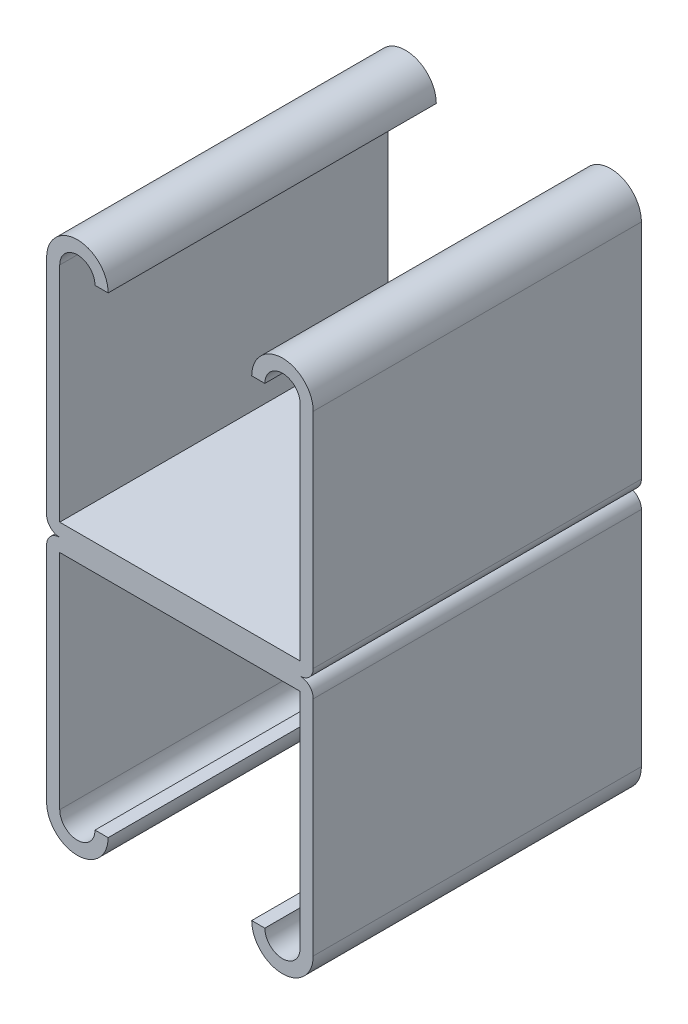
ISO-10303-21;
HEADER;
FILE_DESCRIPTION(('STEP AP214'),'2;1');
FILE_NAME('part.step','',(''),(''),'','','');
FILE_SCHEMA(('AUTOMOTIVE_DESIGN { 1 0 10303 214 1 1 1 1 }'));
ENDSEC;
DATA;
#1=APPLICATION_CONTEXT('core data for automotive mechanical design processes');
#2=APPLICATION_PROTOCOL_DEFINITION('international standard','automotive_design',2000,#1);
#3=PRODUCT_CONTEXT('',#1,'mechanical');
#4=PRODUCT('Part','Part','',(#3));
#5=PRODUCT_RELATED_PRODUCT_CATEGORY('part','',(#4));
#6=PRODUCT_DEFINITION_FORMATION('','',#4);
#7=PRODUCT_DEFINITION_CONTEXT('part definition',#1,'design');
#8=PRODUCT_DEFINITION('design','',#6,#7);
#9=PRODUCT_DEFINITION_SHAPE('','',#8);
#10=(LENGTH_UNIT() NAMED_UNIT(*) SI_UNIT(.MILLI.,.METRE.));
#11=(NAMED_UNIT(*) PLANE_ANGLE_UNIT() SI_UNIT($,.RADIAN.));
#12=(NAMED_UNIT(*) SI_UNIT($,.STERADIAN.) SOLID_ANGLE_UNIT());
#13=UNCERTAINTY_MEASURE_WITH_UNIT(LENGTH_MEASURE(1.E-05),#10,'distance_accuracy_value','');
#14=(GEOMETRIC_REPRESENTATION_CONTEXT(3) GLOBAL_UNCERTAINTY_ASSIGNED_CONTEXT((#13)) GLOBAL_UNIT_ASSIGNED_CONTEXT((#10,
#11,#12)) REPRESENTATION_CONTEXT('',''));
#15=CARTESIAN_POINT('',(0.,0.,0.));
#16=DIRECTION('',(0.,0.,1.));
#17=DIRECTION('',(1.,0.,0.));
#18=AXIS2_PLACEMENT_3D('',#15,#16,#17);
#19=CARTESIAN_POINT('',(-7.9375,18.25625,12.7));
#20=DIRECTION('',(0.,0.,-1.));
#21=DIRECTION('',(-1.,0.,0.));
#22=AXIS2_PLACEMENT_3D('',#19,#20,#21);
#23=CYLINDRICAL_SURFACE('',#22,2.38125);
#24=CARTESIAN_POINT('',(-7.9375,18.25625,-12.7));
#25=DIRECTION('',(0.,0.,1.));
#26=DIRECTION('',(-1.,0.,0.));
#27=AXIS2_PLACEMENT_3D('',#24,#25,#26);
#28=CIRCLE('',#27,2.38125);
#29=CARTESIAN_POINT('',(-5.55625,18.25625,-12.7));
#30=VERTEX_POINT('',#29);
#31=CARTESIAN_POINT('',(-10.31875,18.25625,-12.7));
#32=VERTEX_POINT('',#31);
#33=EDGE_CURVE('E165',#30,#32,#28,.T.);
#34=ORIENTED_EDGE('',*,*,#33,.T.);
#35=DIRECTION('',(0.,0.,-1.));
#36=VECTOR('',#35,1.);
#37=CARTESIAN_POINT('',(-10.31875,18.25625,12.7));
#38=LINE('',#37,#36);
#39=CARTESIAN_POINT('',(-10.31875,18.25625,12.7));
#40=VERTEX_POINT('',#39);
#41=EDGE_CURVE('E11',#40,#32,#38,.T.);
#42=ORIENTED_EDGE('',*,*,#41,.F.);
#43=CARTESIAN_POINT('',(-7.9375,18.25625,12.7));
#44=DIRECTION('',(0.,0.,1.));
#45=DIRECTION('',(-1.,0.,0.));
#46=AXIS2_PLACEMENT_3D('',#43,#44,#45);
#47=CIRCLE('',#46,2.38125);
#48=CARTESIAN_POINT('',(-5.55625,18.25625,12.7));
#49=VERTEX_POINT('',#48);
#50=EDGE_CURVE('E190',#49,#40,#47,.T.);
#51=ORIENTED_EDGE('',*,*,#50,.F.);
#52=DIRECTION('',(0.,0.,-1.));
#53=VECTOR('',#52,1.);
#54=CARTESIAN_POINT('',(-5.55625,18.25625,12.7));
#55=LINE('',#54,#53);
#56=EDGE_CURVE('E161',#49,#30,#55,.T.);
#57=ORIENTED_EDGE('',*,*,#56,.T.);
#58=EDGE_LOOP('',(#34,#42,#51,#57));
#59=FACE_BOUND('',#58,.T.);
#60=ADVANCED_FACE('F32',(#59),#23,.T.);
#61=CARTESIAN_POINT('',(-10.31875,18.25625,12.7));
#62=DIRECTION('',(1.,0.,0.));
#63=DIRECTION('',(0.,1.,0.));
#64=AXIS2_PLACEMENT_3D('',#61,#62,#63);
#65=PLANE('',#64);
#66=DIRECTION('',(0.,-1.,0.));
#67=VECTOR('',#66,1.);
#68=CARTESIAN_POINT('',(-10.31875,18.25625,-12.7));
#69=LINE('',#68,#67);
#70=CARTESIAN_POINT('',(-10.31875,1.016,-12.7));
#71=VERTEX_POINT('',#70);
#72=EDGE_CURVE('E168',#32,#71,#69,.T.);
#73=ORIENTED_EDGE('',*,*,#72,.T.);
#74=DIRECTION('',(0.,0.,-1.));
#75=VECTOR('',#74,1.);
#76=CARTESIAN_POINT('',(-10.31875,1.016,12.7));
#77=LINE('',#76,#75);
#78=CARTESIAN_POINT('',(-10.31875,1.016,12.7));
#79=VERTEX_POINT('',#78);
#80=EDGE_CURVE('E40',#79,#71,#77,.T.);
#81=ORIENTED_EDGE('',*,*,#80,.F.);
#82=DIRECTION('',(0.,-1.,0.));
#83=VECTOR('',#82,1.);
#84=CARTESIAN_POINT('',(-10.31875,18.25625,12.7));
#85=LINE('',#84,#83);
#86=EDGE_CURVE('E107',#40,#79,#85,.T.);
#87=ORIENTED_EDGE('',*,*,#86,.F.);
#88=ORIENTED_EDGE('',*,*,#41,.T.);
#89=EDGE_LOOP('',(#73,#81,#87,#88));
#90=FACE_BOUND('',#89,.T.);
#91=ADVANCED_FACE('F320',(#90),#65,.F.);
#92=CARTESIAN_POINT('',(-9.30275,1.016,12.7));
#93=DIRECTION('',(0.,0.,-1.));
#94=DIRECTION('',(-1.,0.,0.));
#95=AXIS2_PLACEMENT_3D('',#92,#93,#94);
#96=CYLINDRICAL_SURFACE('',#95,1.016);
#97=CARTESIAN_POINT('',(-9.30275,1.016,-12.7));
#98=DIRECTION('',(0.,0.,1.));
#99=DIRECTION('',(-1.,0.,0.));
#100=AXIS2_PLACEMENT_3D('',#97,#98,#99);
#101=CIRCLE('',#100,1.016);
#102=CARTESIAN_POINT('',(-9.30275,0.,-12.7));
#103=VERTEX_POINT('',#102);
#104=EDGE_CURVE('E171',#71,#103,#101,.T.);
#105=ORIENTED_EDGE('',*,*,#104,.T.);
#106=DIRECTION('',(0.,0.,-1.));
#107=VECTOR('',#106,1.);
#108=CARTESIAN_POINT('',(-9.30275,0.,12.7));
#109=LINE('',#108,#107);
#110=CARTESIAN_POINT('',(-9.30275,0.,12.7));
#111=VERTEX_POINT('',#110);
#112=EDGE_CURVE('E215',#111,#103,#109,.T.);
#113=ORIENTED_EDGE('',*,*,#112,.F.);
#114=CARTESIAN_POINT('',(-9.30275,1.016,12.7));
#115=DIRECTION('',(0.,0.,1.));
#116=DIRECTION('',(-1.,0.,0.));
#117=AXIS2_PLACEMENT_3D('',#114,#115,#116);
#118=CIRCLE('',#117,1.016);
#119=EDGE_CURVE('E223',#79,#111,#118,.T.);
#120=ORIENTED_EDGE('',*,*,#119,.F.);
#121=ORIENTED_EDGE('',*,*,#80,.T.);
#122=EDGE_LOOP('',(#105,#113,#120,#121));
#123=FACE_BOUND('',#122,.T.);
#124=ADVANCED_FACE('F221',(#123),#96,.T.);
#125=CARTESIAN_POINT('',(9.30275,1.016,12.7));
#126=DIRECTION('',(0.,0.,-1.));
#127=DIRECTION('',(-1.,0.,0.));
#128=AXIS2_PLACEMENT_3D('',#125,#126,#127);
#129=CYLINDRICAL_SURFACE('',#128,1.016);
#130=CARTESIAN_POINT('',(9.30275,1.016,-12.7));
#131=DIRECTION('',(0.,0.,1.));
#132=DIRECTION('',(1.,0.,0.));
#133=AXIS2_PLACEMENT_3D('',#130,#131,#132);
#134=CIRCLE('',#133,1.016);
#135=CARTESIAN_POINT('',(9.30275,0.,-12.7));
#136=VERTEX_POINT('',#135);
#137=CARTESIAN_POINT('',(10.31875,1.016,-12.7));
#138=VERTEX_POINT('',#137);
#139=EDGE_CURVE('E173',#136,#138,#134,.T.);
#140=ORIENTED_EDGE('',*,*,#139,.T.);
#141=DIRECTION('',(0.,0.,-1.));
#142=VECTOR('',#141,1.);
#143=CARTESIAN_POINT('',(10.31875,1.016,12.7));
#144=LINE('',#143,#142);
#145=CARTESIAN_POINT('',(10.31875,1.016,12.7));
#146=VERTEX_POINT('',#145);
#147=EDGE_CURVE('E209',#146,#138,#144,.T.);
#148=ORIENTED_EDGE('',*,*,#147,.F.);
#149=CARTESIAN_POINT('',(9.30275,1.016,12.7));
#150=DIRECTION('',(0.,0.,1.));
#151=DIRECTION('',(1.,0.,0.));
#152=AXIS2_PLACEMENT_3D('',#149,#150,#151);
#153=CIRCLE('',#152,1.016);
#154=CARTESIAN_POINT('',(9.30275,0.,12.7));
#155=VERTEX_POINT('',#154);
#156=EDGE_CURVE('E285',#155,#146,#153,.T.);
#157=ORIENTED_EDGE('',*,*,#156,.F.);
#158=DIRECTION('',(0.,0.,-1.));
#159=VECTOR('',#158,1.);
#160=CARTESIAN_POINT('',(9.30275,0.,12.7));
#161=LINE('',#160,#159);
#162=EDGE_CURVE('E212',#155,#136,#161,.T.);
#163=ORIENTED_EDGE('',*,*,#162,.T.);
#164=EDGE_LOOP('',(#140,#148,#157,#163));
#165=FACE_BOUND('',#164,.T.);
#166=ADVANCED_FACE('F327',(#165),#129,.T.);
#167=CARTESIAN_POINT('',(10.31875,1.016,12.7));
#168=DIRECTION('',(-1.,0.,0.));
#169=DIRECTION('',(0.,-1.,0.));
#170=AXIS2_PLACEMENT_3D('',#167,#168,#169);
#171=PLANE('',#170);
#172=DIRECTION('',(0.,1.,0.));
#173=VECTOR('',#172,1.);
#174=CARTESIAN_POINT('',(10.31875,1.016,-12.7));
#175=LINE('',#174,#173);
#176=CARTESIAN_POINT('',(10.31875,18.25625,-12.7));
#177=VERTEX_POINT('',#176);
#178=EDGE_CURVE('E175',#138,#177,#175,.T.);
#179=ORIENTED_EDGE('',*,*,#178,.T.);
#180=DIRECTION('',(0.,0.,-1.));
#181=VECTOR('',#180,1.);
#182=CARTESIAN_POINT('',(10.31875,18.25625,12.7));
#183=LINE('',#182,#181);
#184=CARTESIAN_POINT('',(10.31875,18.25625,12.7));
#185=VERTEX_POINT('',#184);
#186=EDGE_CURVE('E206',#185,#177,#183,.T.);
#187=ORIENTED_EDGE('',*,*,#186,.F.);
#188=DIRECTION('',(0.,1.,0.));
#189=VECTOR('',#188,1.);
#190=CARTESIAN_POINT('',(10.31875,1.016,12.7));
#191=LINE('',#190,#189);
#192=EDGE_CURVE('E287',#146,#185,#191,.T.);
#193=ORIENTED_EDGE('',*,*,#192,.F.);
#194=ORIENTED_EDGE('',*,*,#147,.T.);
#195=EDGE_LOOP('',(#179,#187,#193,#194));
#196=FACE_BOUND('',#195,.T.);
#197=ADVANCED_FACE('F332',(#196),#171,.F.);
#198=CARTESIAN_POINT('',(7.9375,18.25625,12.7));
#199=DIRECTION('',(0.,0.,-1.));
#200=DIRECTION('',(-1.,0.,0.));
#201=AXIS2_PLACEMENT_3D('',#198,#199,#200);
#202=CYLINDRICAL_SURFACE('',#201,2.38125);
#203=CARTESIAN_POINT('',(7.9375,18.25625,-12.7));
#204=DIRECTION('',(0.,0.,1.));
#205=DIRECTION('',(1.,0.,0.));
#206=AXIS2_PLACEMENT_3D('',#203,#204,#205);
#207=CIRCLE('',#206,2.38125);
#208=CARTESIAN_POINT('',(5.55625,18.25625,-12.7));
#209=VERTEX_POINT('',#208);
#210=EDGE_CURVE('E177',#177,#209,#207,.T.);
#211=ORIENTED_EDGE('',*,*,#210,.T.);
#212=DIRECTION('',(0.,0.,-1.));
#213=VECTOR('',#212,1.);
#214=CARTESIAN_POINT('',(5.55625,18.25625,12.7));
#215=LINE('',#214,#213);
#216=CARTESIAN_POINT('',(5.55625,18.25625,12.7));
#217=VERTEX_POINT('',#216);
#218=EDGE_CURVE('E203',#217,#209,#215,.T.);
#219=ORIENTED_EDGE('',*,*,#218,.F.);
#220=CARTESIAN_POINT('',(7.9375,18.25625,12.7));
#221=DIRECTION('',(0.,0.,1.));
#222=DIRECTION('',(1.,0.,0.));
#223=AXIS2_PLACEMENT_3D('',#220,#221,#222);
#224=CIRCLE('',#223,2.38125);
#225=EDGE_CURVE('E289',#185,#217,#224,.T.);
#226=ORIENTED_EDGE('',*,*,#225,.F.);
#227=ORIENTED_EDGE('',*,*,#186,.T.);
#228=EDGE_LOOP('',(#211,#219,#226,#227));
#229=FACE_BOUND('',#228,.T.);
#230=ADVANCED_FACE('F336',(#229),#202,.T.);
#231=CARTESIAN_POINT('',(5.55625,18.25625,12.7));
#232=DIRECTION('',(0.,1.,0.));
#233=DIRECTION('',(0.,0.,1.));
#234=AXIS2_PLACEMENT_3D('',#231,#232,#233);
#235=PLANE('',#234);
#236=DIRECTION('',(1.,0.,0.));
#237=VECTOR('',#236,1.);
#238=CARTESIAN_POINT('',(5.55625,18.25625,-12.7));
#239=LINE('',#238,#237);
#240=CARTESIAN_POINT('',(6.57225,18.25625,-12.7));
#241=VERTEX_POINT('',#240);
#242=EDGE_CURVE('E179',#209,#241,#239,.T.);
#243=ORIENTED_EDGE('',*,*,#242,.T.);
#244=DIRECTION('',(0.,0.,-1.));
#245=VECTOR('',#244,1.);
#246=CARTESIAN_POINT('',(6.57225,18.25625,12.7));
#247=LINE('',#246,#245);
#248=CARTESIAN_POINT('',(6.57225,18.25625,12.7));
#249=VERTEX_POINT('',#248);
#250=EDGE_CURVE('E200',#249,#241,#247,.T.);
#251=ORIENTED_EDGE('',*,*,#250,.F.);
#252=DIRECTION('',(1.,0.,0.));
#253=VECTOR('',#252,1.);
#254=CARTESIAN_POINT('',(5.55625,18.25625,12.7));
#255=LINE('',#254,#253);
#256=EDGE_CURVE('E291',#217,#249,#255,.T.);
#257=ORIENTED_EDGE('',*,*,#256,.F.);
#258=ORIENTED_EDGE('',*,*,#218,.T.);
#259=EDGE_LOOP('',(#243,#251,#257,#258));
#260=FACE_BOUND('',#259,.T.);
#261=ADVANCED_FACE('F340',(#260),#235,.F.);
#262=CARTESIAN_POINT('',(7.9375,18.25625,12.7));
#263=DIRECTION('',(0.,0.,-1.));
#264=DIRECTION('',(-1.,0.,0.));
#265=AXIS2_PLACEMENT_3D('',#262,#263,#264);
#266=CYLINDRICAL_SURFACE('',#265,1.36525);
#267=CARTESIAN_POINT('',(7.9375,18.25625,-12.7));
#268=DIRECTION('',(0.,0.,-1.));
#269=DIRECTION('',(1.,0.,0.));
#270=AXIS2_PLACEMENT_3D('',#267,#268,#269);
#271=CIRCLE('',#270,1.36525);
#272=CARTESIAN_POINT('',(9.30275,18.25625,-12.7));
#273=VERTEX_POINT('',#272);
#274=EDGE_CURVE('E181',#241,#273,#271,.T.);
#275=ORIENTED_EDGE('',*,*,#274,.T.);
#276=DIRECTION('',(0.,0.,-1.));
#277=VECTOR('',#276,1.);
#278=CARTESIAN_POINT('',(9.30275,18.25625,12.7));
#279=LINE('',#278,#277);
#280=CARTESIAN_POINT('',(9.30275,18.25625,12.7));
#281=VERTEX_POINT('',#280);
#282=EDGE_CURVE('E197',#281,#273,#279,.T.);
#283=ORIENTED_EDGE('',*,*,#282,.F.);
#284=CARTESIAN_POINT('',(7.9375,18.25625,12.7));
#285=DIRECTION('',(0.,0.,-1.));
#286=DIRECTION('',(1.,0.,0.));
#287=AXIS2_PLACEMENT_3D('',#284,#285,#286);
#288=CIRCLE('',#287,1.36525);
#289=EDGE_CURVE('E293',#249,#281,#288,.T.);
#290=ORIENTED_EDGE('',*,*,#289,.F.);
#291=ORIENTED_EDGE('',*,*,#250,.T.);
#292=EDGE_LOOP('',(#275,#283,#290,#291));
#293=FACE_BOUND('',#292,.T.);
#294=ADVANCED_FACE('F344',(#293),#266,.F.);
#295=CARTESIAN_POINT('',(9.30275,1.016,12.7));
#296=DIRECTION('',(1.,0.,0.));
#297=DIRECTION('',(0.,0.,-1.));
#298=AXIS2_PLACEMENT_3D('',#295,#296,#297);
#299=PLANE('',#298);
#300=DIRECTION('',(0.,-1.,0.));
#301=VECTOR('',#300,1.);
#302=CARTESIAN_POINT('',(9.30275,1.016,-12.7));
#303=LINE('',#302,#301);
#304=CARTESIAN_POINT('',(9.30275,1.016,-12.7));
#305=VERTEX_POINT('',#304);
#306=EDGE_CURVE('E183',#273,#305,#303,.T.);
#307=ORIENTED_EDGE('',*,*,#306,.T.);
#308=DIRECTION('',(0.,0.,-1.));
#309=VECTOR('',#308,1.);
#310=CARTESIAN_POINT('',(9.30275,1.016,12.7));
#311=LINE('',#310,#309);
#312=CARTESIAN_POINT('',(9.30275,1.016,12.7));
#313=VERTEX_POINT('',#312);
#314=EDGE_CURVE('E194',#313,#305,#311,.T.);
#315=ORIENTED_EDGE('',*,*,#314,.F.);
#316=DIRECTION('',(0.,-1.,0.));
#317=VECTOR('',#316,1.);
#318=CARTESIAN_POINT('',(9.30275,1.016,12.7));
#319=LINE('',#318,#317);
#320=EDGE_CURVE('E295',#281,#313,#319,.T.);
#321=ORIENTED_EDGE('',*,*,#320,.F.);
#322=ORIENTED_EDGE('',*,*,#282,.T.);
#323=EDGE_LOOP('',(#307,#315,#321,#322));
#324=FACE_BOUND('',#323,.T.);
#325=ADVANCED_FACE('F301',(#324),#299,.F.);
#326=CARTESIAN_POINT('',(-9.30275,1.016,12.7));
#327=DIRECTION('',(0.,-1.,0.));
#328=DIRECTION('',(1.,0.,0.));
#329=AXIS2_PLACEMENT_3D('',#326,#327,#328);
#330=PLANE('',#329);
#331=DIRECTION('',(-1.,0.,0.));
#332=VECTOR('',#331,1.);
#333=CARTESIAN_POINT('',(-9.30275,1.016,-12.7));
#334=LINE('',#333,#332);
#335=CARTESIAN_POINT('',(-9.30275,1.016,-12.7));
#336=VERTEX_POINT('',#335);
#337=EDGE_CURVE('E185',#305,#336,#334,.T.);
#338=ORIENTED_EDGE('',*,*,#337,.T.);
#339=DIRECTION('',(0.,0.,-1.));
#340=VECTOR('',#339,1.);
#341=CARTESIAN_POINT('',(-9.30275,1.016,12.7));
#342=LINE('',#341,#340);
#343=CARTESIAN_POINT('',(-9.30275,1.016,12.7));
#344=VERTEX_POINT('',#343);
#345=EDGE_CURVE('E156',#344,#336,#342,.T.);
#346=ORIENTED_EDGE('',*,*,#345,.F.);
#347=DIRECTION('',(-1.,0.,0.));
#348=VECTOR('',#347,1.);
#349=CARTESIAN_POINT('',(-9.30275,1.016,12.7));
#350=LINE('',#349,#348);
#351=EDGE_CURVE('E147',#313,#344,#350,.T.);
#352=ORIENTED_EDGE('',*,*,#351,.F.);
#353=ORIENTED_EDGE('',*,*,#314,.T.);
#354=EDGE_LOOP('',(#338,#346,#352,#353));
#355=FACE_BOUND('',#354,.T.);
#356=ADVANCED_FACE('F305',(#355),#330,.F.);
#357=CARTESIAN_POINT('',(-9.30275,18.25625,12.7));
#358=DIRECTION('',(-1.,0.,0.));
#359=DIRECTION('',(0.,-1.,0.));
#360=AXIS2_PLACEMENT_3D('',#357,#358,#359);
#361=PLANE('',#360);
#362=DIRECTION('',(0.,1.,0.));
#363=VECTOR('',#362,1.);
#364=CARTESIAN_POINT('',(-9.30275,18.25625,-12.7));
#365=LINE('',#364,#363);
#366=CARTESIAN_POINT('',(-9.30275,18.25625,-12.7));
#367=VERTEX_POINT('',#366);
#368=EDGE_CURVE('E155',#336,#367,#365,.T.);
#369=ORIENTED_EDGE('',*,*,#368,.T.);
#370=DIRECTION('',(0.,0.,-1.));
#371=VECTOR('',#370,1.);
#372=CARTESIAN_POINT('',(-9.30275,18.25625,12.7));
#373=LINE('',#372,#371);
#374=CARTESIAN_POINT('',(-9.30275,18.25625,12.7));
#375=VERTEX_POINT('',#374);
#376=EDGE_CURVE('E152',#375,#367,#373,.T.);
#377=ORIENTED_EDGE('',*,*,#376,.F.);
#378=DIRECTION('',(0.,1.,0.));
#379=VECTOR('',#378,1.);
#380=CARTESIAN_POINT('',(-9.30275,18.25625,12.7));
#381=LINE('',#380,#379);
#382=EDGE_CURVE('E141',#344,#375,#381,.T.);
#383=ORIENTED_EDGE('',*,*,#382,.F.);
#384=ORIENTED_EDGE('',*,*,#345,.T.);
#385=EDGE_LOOP('',(#369,#377,#383,#384));
#386=FACE_BOUND('',#385,.T.);
#387=ADVANCED_FACE('F153',(#386),#361,.F.);
#388=CARTESIAN_POINT('',(-7.9375,18.25625,12.7));
#389=DIRECTION('',(0.,0.,-1.));
#390=DIRECTION('',(-1.,0.,0.));
#391=AXIS2_PLACEMENT_3D('',#388,#389,#390);
#392=CYLINDRICAL_SURFACE('',#391,1.36525);
#393=CARTESIAN_POINT('',(-7.9375,18.25625,-12.7));
#394=DIRECTION('',(0.,0.,-1.));
#395=DIRECTION('',(-1.,0.,0.));
#396=AXIS2_PLACEMENT_3D('',#393,#394,#395);
#397=CIRCLE('',#396,1.36525);
#398=CARTESIAN_POINT('',(-6.57225,18.25625,-12.7));
#399=VERTEX_POINT('',#398);
#400=EDGE_CURVE('E93',#367,#399,#397,.T.);
#401=ORIENTED_EDGE('',*,*,#400,.T.);
#402=DIRECTION('',(0.,0.,-1.));
#403=VECTOR('',#402,1.);
#404=CARTESIAN_POINT('',(-6.57225,18.25625,12.7));
#405=LINE('',#404,#403);
#406=CARTESIAN_POINT('',(-6.57225,18.25625,12.7));
#407=VERTEX_POINT('',#406);
#408=EDGE_CURVE('E157',#407,#399,#405,.T.);
#409=ORIENTED_EDGE('',*,*,#408,.F.);
#410=CARTESIAN_POINT('',(-7.9375,18.25625,12.7));
#411=DIRECTION('',(0.,0.,-1.));
#412=DIRECTION('',(-1.,0.,0.));
#413=AXIS2_PLACEMENT_3D('',#410,#411,#412);
#414=CIRCLE('',#413,1.36525);
#415=EDGE_CURVE('E145',#375,#407,#414,.T.);
#416=ORIENTED_EDGE('',*,*,#415,.F.);
#417=ORIENTED_EDGE('',*,*,#376,.T.);
#418=EDGE_LOOP('',(#401,#409,#416,#417));
#419=FACE_BOUND('',#418,.T.);
#420=ADVANCED_FACE('F159',(#419),#392,.F.);
#421=CARTESIAN_POINT('',(-6.57225,18.25625,12.7));
#422=DIRECTION('',(0.,1.,0.));
#423=DIRECTION('',(0.,0.,1.));
#424=AXIS2_PLACEMENT_3D('',#421,#422,#423);
#425=PLANE('',#424);
#426=DIRECTION('',(1.,0.,0.));
#427=VECTOR('',#426,1.);
#428=CARTESIAN_POINT('',(-6.57225,18.25625,-12.7));
#429=LINE('',#428,#427);
#430=EDGE_CURVE('E99',#399,#30,#429,.T.);
#431=ORIENTED_EDGE('',*,*,#430,.T.);
#432=ORIENTED_EDGE('',*,*,#56,.F.);
#433=DIRECTION('',(1.,0.,0.));
#434=VECTOR('',#433,1.);
#435=CARTESIAN_POINT('',(-6.57225,18.25625,12.7));
#436=LINE('',#435,#434);
#437=EDGE_CURVE('E48',#407,#49,#436,.T.);
#438=ORIENTED_EDGE('',*,*,#437,.F.);
#439=ORIENTED_EDGE('',*,*,#408,.T.);
#440=EDGE_LOOP('',(#431,#432,#438,#439));
#441=FACE_BOUND('',#440,.T.);
#442=ADVANCED_FACE('F309',(#441),#425,.F.);
#443=CARTESIAN_POINT('',(-7.9375,18.25625,12.7));
#444=DIRECTION('',(0.,0.,-1.));
#445=DIRECTION('',(-1.,0.,0.));
#446=AXIS2_PLACEMENT_3D('',#443,#444,#445);
#447=PLANE('',#446);
#448=ORIENTED_EDGE('',*,*,#50,.T.);
#449=ORIENTED_EDGE('',*,*,#86,.T.);
#450=ORIENTED_EDGE('',*,*,#119,.T.);
#451=CARTESIAN_POINT('',(-9.30275,-1.016,12.7));
#452=DIRECTION('',(0.,0.,-1.));
#453=DIRECTION('',(-1.,0.,0.));
#454=AXIS2_PLACEMENT_3D('',#451,#452,#453);
#455=CIRCLE('',#454,1.016);
#456=CARTESIAN_POINT('',(-10.31875,-1.016,12.7));
#457=VERTEX_POINT('',#456);
#458=EDGE_CURVE('E630',#457,#111,#455,.T.);
#459=ORIENTED_EDGE('',*,*,#458,.F.);
#460=DIRECTION('',(0.,1.,0.));
#461=VECTOR('',#460,1.);
#462=CARTESIAN_POINT('',(-10.31875,-18.25625,12.7));
#463=LINE('',#462,#461);
#464=CARTESIAN_POINT('',(-10.31875,-18.25625,12.7));
#465=VERTEX_POINT('',#464);
#466=EDGE_CURVE('E250',#465,#457,#463,.T.);
#467=ORIENTED_EDGE('',*,*,#466,.F.);
#468=CARTESIAN_POINT('',(-7.9375,-18.25625,12.7));
#469=DIRECTION('',(0.,0.,-1.));
#470=DIRECTION('',(-1.,0.,0.));
#471=AXIS2_PLACEMENT_3D('',#468,#469,#470);
#472=CIRCLE('',#471,2.38125);
#473=CARTESIAN_POINT('',(-5.55625,-18.25625,12.7));
#474=VERTEX_POINT('',#473);
#475=EDGE_CURVE('E239',#474,#465,#472,.T.);
#476=ORIENTED_EDGE('',*,*,#475,.F.);
#477=DIRECTION('',(1.,0.,0.));
#478=VECTOR('',#477,1.);
#479=CARTESIAN_POINT('',(-6.57225,-18.25625,12.7));
#480=LINE('',#479,#478);
#481=CARTESIAN_POINT('',(-6.57225,-18.25625,12.7));
#482=VERTEX_POINT('',#481);
#483=EDGE_CURVE('E591',#482,#474,#480,.T.);
#484=ORIENTED_EDGE('',*,*,#483,.F.);
#485=CARTESIAN_POINT('',(-7.9375,-18.25625,12.7));
#486=DIRECTION('',(0.,0.,1.));
#487=DIRECTION('',(-1.,0.,0.));
#488=AXIS2_PLACEMENT_3D('',#485,#486,#487);
#489=CIRCLE('',#488,1.36525);
#490=CARTESIAN_POINT('',(-9.30275,-18.25625,12.7));
#491=VERTEX_POINT('',#490);
#492=EDGE_CURVE('E600',#491,#482,#489,.T.);
#493=ORIENTED_EDGE('',*,*,#492,.F.);
#494=DIRECTION('',(0.,-1.,0.));
#495=VECTOR('',#494,1.);
#496=CARTESIAN_POINT('',(-9.30275,-18.25625,12.7));
#497=LINE('',#496,#495);
#498=CARTESIAN_POINT('',(-9.30275,-1.016,12.7));
#499=VERTEX_POINT('',#498);
#500=EDGE_CURVE('E604',#499,#491,#497,.T.);
#501=ORIENTED_EDGE('',*,*,#500,.F.);
#502=DIRECTION('',(-1.,0.,0.));
#503=VECTOR('',#502,1.);
#504=CARTESIAN_POINT('',(-9.30275,-1.016,12.7));
#505=LINE('',#504,#503);
#506=CARTESIAN_POINT('',(9.30275,-1.016,12.7));
#507=VERTEX_POINT('',#506);
#508=EDGE_CURVE('E606',#507,#499,#505,.T.);
#509=ORIENTED_EDGE('',*,*,#508,.F.);
#510=DIRECTION('',(0.,1.,0.));
#511=VECTOR('',#510,1.);
#512=CARTESIAN_POINT('',(9.30275,-1.016,12.7));
#513=LINE('',#512,#511);
#514=CARTESIAN_POINT('',(9.30275,-18.25625,12.7));
#515=VERTEX_POINT('',#514);
#516=EDGE_CURVE('E612',#515,#507,#513,.T.);
#517=ORIENTED_EDGE('',*,*,#516,.F.);
#518=CARTESIAN_POINT('',(7.9375,-18.25625,12.7));
#519=DIRECTION('',(0.,0.,1.));
#520=DIRECTION('',(1.,0.,0.));
#521=AXIS2_PLACEMENT_3D('',#518,#519,#520);
#522=CIRCLE('',#521,1.36525);
#523=CARTESIAN_POINT('',(6.57225,-18.25625,12.7));
#524=VERTEX_POINT('',#523);
#525=EDGE_CURVE('E615',#524,#515,#522,.T.);
#526=ORIENTED_EDGE('',*,*,#525,.F.);
#527=DIRECTION('',(1.,0.,0.));
#528=VECTOR('',#527,1.);
#529=CARTESIAN_POINT('',(5.55625,-18.25625,12.7));
#530=LINE('',#529,#528);
#531=CARTESIAN_POINT('',(5.55625,-18.25625,12.7));
#532=VERTEX_POINT('',#531);
#533=EDGE_CURVE('E618',#532,#524,#530,.T.);
#534=ORIENTED_EDGE('',*,*,#533,.F.);
#535=CARTESIAN_POINT('',(7.9375,-18.25625,12.7));
#536=DIRECTION('',(0.,0.,-1.));
#537=DIRECTION('',(1.,0.,0.));
#538=AXIS2_PLACEMENT_3D('',#535,#536,#537);
#539=CIRCLE('',#538,2.38125);
#540=CARTESIAN_POINT('',(10.31875,-18.25625,12.7));
#541=VERTEX_POINT('',#540);
#542=EDGE_CURVE('E621',#541,#532,#539,.T.);
#543=ORIENTED_EDGE('',*,*,#542,.F.);
#544=DIRECTION('',(0.,-1.,0.));
#545=VECTOR('',#544,1.);
#546=CARTESIAN_POINT('',(10.31875,-1.016,12.7));
#547=LINE('',#546,#545);
#548=CARTESIAN_POINT('',(10.31875,-1.016,12.7));
#549=VERTEX_POINT('',#548);
#550=EDGE_CURVE('E624',#549,#541,#547,.T.);
#551=ORIENTED_EDGE('',*,*,#550,.F.);
#552=CARTESIAN_POINT('',(9.30275,-1.016,12.7));
#553=DIRECTION('',(0.,0.,-1.));
#554=DIRECTION('',(1.,0.,0.));
#555=AXIS2_PLACEMENT_3D('',#552,#553,#554);
#556=CIRCLE('',#555,1.016);
#557=EDGE_CURVE('E627',#155,#549,#556,.T.);
#558=ORIENTED_EDGE('',*,*,#557,.F.);
#559=ORIENTED_EDGE('',*,*,#156,.T.);
#560=ORIENTED_EDGE('',*,*,#192,.T.);
#561=ORIENTED_EDGE('',*,*,#225,.T.);
#562=ORIENTED_EDGE('',*,*,#256,.T.);
#563=ORIENTED_EDGE('',*,*,#289,.T.);
#564=ORIENTED_EDGE('',*,*,#320,.T.);
#565=ORIENTED_EDGE('',*,*,#351,.T.);
#566=ORIENTED_EDGE('',*,*,#382,.T.);
#567=ORIENTED_EDGE('',*,*,#415,.T.);
#568=ORIENTED_EDGE('',*,*,#437,.T.);
#569=EDGE_LOOP('',(#448,#449,#450,#459,#467,#476,#484,#493,#501,#509,#517,#526,#534,#543,#551,
#558,#559,#560,#561,#562,#563,#564,#565,#566,#567,#568));
#570=FACE_BOUND('',#569,.T.);
#571=ADVANCED_FACE('F143',(#570),#447,.F.);
#572=CARTESIAN_POINT('',(-7.9375,18.25625,-12.7));
#573=DIRECTION('',(0.,0.,-1.));
#574=DIRECTION('',(-1.,0.,0.));
#575=AXIS2_PLACEMENT_3D('',#572,#573,#574);
#576=PLANE('',#575);
#577=ORIENTED_EDGE('',*,*,#33,.F.);
#578=ORIENTED_EDGE('',*,*,#430,.F.);
#579=ORIENTED_EDGE('',*,*,#400,.F.);
#580=ORIENTED_EDGE('',*,*,#368,.F.);
#581=ORIENTED_EDGE('',*,*,#337,.F.);
#582=ORIENTED_EDGE('',*,*,#306,.F.);
#583=ORIENTED_EDGE('',*,*,#274,.F.);
#584=ORIENTED_EDGE('',*,*,#242,.F.);
#585=ORIENTED_EDGE('',*,*,#210,.F.);
#586=ORIENTED_EDGE('',*,*,#178,.F.);
#587=ORIENTED_EDGE('',*,*,#139,.F.);
#588=CARTESIAN_POINT('',(9.30275,-1.016,-12.7));
#589=DIRECTION('',(0.,0.,-1.));
#590=DIRECTION('',(1.,0.,0.));
#591=AXIS2_PLACEMENT_3D('',#588,#589,#590);
#592=CIRCLE('',#591,1.016);
#593=CARTESIAN_POINT('',(10.31875,-1.016,-12.7));
#594=VERTEX_POINT('',#593);
#595=EDGE_CURVE('E237',#136,#594,#592,.T.);
#596=ORIENTED_EDGE('',*,*,#595,.T.);
#597=DIRECTION('',(0.,-1.,0.));
#598=VECTOR('',#597,1.);
#599=CARTESIAN_POINT('',(10.31875,-1.016,-12.7));
#600=LINE('',#599,#598);
#601=CARTESIAN_POINT('',(10.31875,-18.25625,-12.7));
#602=VERTEX_POINT('',#601);
#603=EDGE_CURVE('E242',#594,#602,#600,.T.);
#604=ORIENTED_EDGE('',*,*,#603,.T.);
#605=CARTESIAN_POINT('',(7.9375,-18.25625,-12.7));
#606=DIRECTION('',(0.,0.,-1.));
#607=DIRECTION('',(1.,0.,0.));
#608=AXIS2_PLACEMENT_3D('',#605,#606,#607);
#609=CIRCLE('',#608,2.38125);
#610=CARTESIAN_POINT('',(5.55625,-18.25625,-12.7));
#611=VERTEX_POINT('',#610);
#612=EDGE_CURVE('E654',#602,#611,#609,.T.);
#613=ORIENTED_EDGE('',*,*,#612,.T.);
#614=DIRECTION('',(1.,0.,0.));
#615=VECTOR('',#614,1.);
#616=CARTESIAN_POINT('',(5.55625,-18.25625,-12.7));
#617=LINE('',#616,#615);
#618=CARTESIAN_POINT('',(6.57225,-18.25625,-12.7));
#619=VERTEX_POINT('',#618);
#620=EDGE_CURVE('E651',#611,#619,#617,.T.);
#621=ORIENTED_EDGE('',*,*,#620,.T.);
#622=CARTESIAN_POINT('',(7.9375,-18.25625,-12.7));
#623=DIRECTION('',(0.,0.,1.));
#624=DIRECTION('',(1.,0.,0.));
#625=AXIS2_PLACEMENT_3D('',#622,#623,#624);
#626=CIRCLE('',#625,1.36525);
#627=CARTESIAN_POINT('',(9.30275,-18.25625,-12.7));
#628=VERTEX_POINT('',#627);
#629=EDGE_CURVE('E648',#619,#628,#626,.T.);
#630=ORIENTED_EDGE('',*,*,#629,.T.);
#631=DIRECTION('',(0.,1.,0.));
#632=VECTOR('',#631,1.);
#633=CARTESIAN_POINT('',(9.30275,-1.016,-12.7));
#634=LINE('',#633,#632);
#635=CARTESIAN_POINT('',(9.30275,-1.016,-12.7));
#636=VERTEX_POINT('',#635);
#637=EDGE_CURVE('E645',#628,#636,#634,.T.);
#638=ORIENTED_EDGE('',*,*,#637,.T.);
#639=DIRECTION('',(-1.,0.,0.));
#640=VECTOR('',#639,1.);
#641=CARTESIAN_POINT('',(-9.30275,-1.016,-12.7));
#642=LINE('',#641,#640);
#643=CARTESIAN_POINT('',(-9.30275,-1.016,-12.7));
#644=VERTEX_POINT('',#643);
#645=EDGE_CURVE('E642',#636,#644,#642,.T.);
#646=ORIENTED_EDGE('',*,*,#645,.T.);
#647=DIRECTION('',(0.,-1.,0.));
#648=VECTOR('',#647,1.);
#649=CARTESIAN_POINT('',(-9.30275,-18.25625,-12.7));
#650=LINE('',#649,#648);
#651=CARTESIAN_POINT('',(-9.30275,-18.25625,-12.7));
#652=VERTEX_POINT('',#651);
#653=EDGE_CURVE('E639',#644,#652,#650,.T.);
#654=ORIENTED_EDGE('',*,*,#653,.T.);
#655=CARTESIAN_POINT('',(-7.9375,-18.25625,-12.7));
#656=DIRECTION('',(0.,0.,1.));
#657=DIRECTION('',(-1.,0.,0.));
#658=AXIS2_PLACEMENT_3D('',#655,#656,#657);
#659=CIRCLE('',#658,1.36525);
#660=CARTESIAN_POINT('',(-6.57225,-18.25625,-12.7));
#661=VERTEX_POINT('',#660);
#662=EDGE_CURVE('E637',#652,#661,#659,.T.);
#663=ORIENTED_EDGE('',*,*,#662,.T.);
#664=DIRECTION('',(1.,0.,0.));
#665=VECTOR('',#664,1.);
#666=CARTESIAN_POINT('',(-6.57225,-18.25625,-12.7));
#667=LINE('',#666,#665);
#668=CARTESIAN_POINT('',(-5.55625,-18.25625,-12.7));
#669=VERTEX_POINT('',#668);
#670=EDGE_CURVE('E593',#661,#669,#667,.T.);
#671=ORIENTED_EDGE('',*,*,#670,.T.);
#672=CARTESIAN_POINT('',(-7.9375,-18.25625,-12.7));
#673=DIRECTION('',(0.,0.,-1.));
#674=DIRECTION('',(-1.,0.,0.));
#675=AXIS2_PLACEMENT_3D('',#672,#673,#674);
#676=CIRCLE('',#675,2.38125);
#677=CARTESIAN_POINT('',(-10.31875,-18.25625,-12.7));
#678=VERTEX_POINT('',#677);
#679=EDGE_CURVE('E634',#669,#678,#676,.T.);
#680=ORIENTED_EDGE('',*,*,#679,.T.);
#681=DIRECTION('',(0.,1.,0.));
#682=VECTOR('',#681,1.);
#683=CARTESIAN_POINT('',(-10.31875,-18.25625,-12.7));
#684=LINE('',#683,#682);
#685=CARTESIAN_POINT('',(-10.31875,-1.016,-12.7));
#686=VERTEX_POINT('',#685);
#687=EDGE_CURVE('E234',#678,#686,#684,.T.);
#688=ORIENTED_EDGE('',*,*,#687,.T.);
#689=CARTESIAN_POINT('',(-9.30275,-1.016,-12.7));
#690=DIRECTION('',(0.,0.,-1.));
#691=DIRECTION('',(-1.,0.,0.));
#692=AXIS2_PLACEMENT_3D('',#689,#690,#691);
#693=CIRCLE('',#692,1.016);
#694=EDGE_CURVE('E230',#686,#103,#693,.T.);
#695=ORIENTED_EDGE('',*,*,#694,.T.);
#696=ORIENTED_EDGE('',*,*,#104,.F.);
#697=ORIENTED_EDGE('',*,*,#72,.F.);
#698=EDGE_LOOP('',(#577,#578,#579,#580,#581,#582,#583,#584,#585,#586,#587,#596,#604,#613,#621,
#630,#638,#646,#654,#663,#671,#680,#688,#695,#696,#697));
#699=FACE_BOUND('',#698,.T.);
#700=ADVANCED_FACE('F227',(#699),#576,.T.);
#701=CARTESIAN_POINT('',(-7.9375,-18.25625,12.7));
#702=DIRECTION('',(0.,0.,-1.));
#703=DIRECTION('',(-1.,0.,0.));
#704=AXIS2_PLACEMENT_3D('',#701,#702,#703);
#705=CYLINDRICAL_SURFACE('',#704,2.38125);
#706=ORIENTED_EDGE('',*,*,#679,.F.);
#707=DIRECTION('',(0.,0.,-1.));
#708=VECTOR('',#707,1.);
#709=CARTESIAN_POINT('',(-5.55625,-18.25625,12.7));
#710=LINE('',#709,#708);
#711=EDGE_CURVE('E169',#474,#669,#710,.T.);
#712=ORIENTED_EDGE('',*,*,#711,.F.);
#713=ORIENTED_EDGE('',*,*,#475,.T.);
#714=DIRECTION('',(0.,0.,-1.));
#715=VECTOR('',#714,1.);
#716=CARTESIAN_POINT('',(-10.31875,-18.25625,12.7));
#717=LINE('',#716,#715);
#718=EDGE_CURVE('E246',#465,#678,#717,.T.);
#719=ORIENTED_EDGE('',*,*,#718,.T.);
#720=EDGE_LOOP('',(#706,#712,#713,#719));
#721=FACE_BOUND('',#720,.T.);
#722=ADVANCED_FACE('F397',(#721),#705,.T.);
#723=CARTESIAN_POINT('',(-6.57225,-18.25625,12.7));
#724=DIRECTION('',(0.,1.,0.));
#725=DIRECTION('',(0.,0.,1.));
#726=AXIS2_PLACEMENT_3D('',#723,#724,#725);
#727=PLANE('',#726);
#728=ORIENTED_EDGE('',*,*,#670,.F.);
#729=DIRECTION('',(0.,0.,-1.));
#730=VECTOR('',#729,1.);
#731=CARTESIAN_POINT('',(-6.57225,-18.25625,12.7));
#732=LINE('',#731,#730);
#733=EDGE_CURVE('E277',#482,#661,#732,.T.);
#734=ORIENTED_EDGE('',*,*,#733,.F.);
#735=ORIENTED_EDGE('',*,*,#483,.T.);
#736=ORIENTED_EDGE('',*,*,#711,.T.);
#737=EDGE_LOOP('',(#728,#734,#735,#736));
#738=FACE_BOUND('',#737,.T.);
#739=ADVANCED_FACE('F405',(#738),#727,.T.);
#740=CARTESIAN_POINT('',(-7.9375,-18.25625,12.7));
#741=DIRECTION('',(0.,0.,-1.));
#742=DIRECTION('',(-1.,0.,0.));
#743=AXIS2_PLACEMENT_3D('',#740,#741,#742);
#744=CYLINDRICAL_SURFACE('',#743,1.36525);
#745=ORIENTED_EDGE('',*,*,#662,.F.);
#746=DIRECTION('',(0.,0.,-1.));
#747=VECTOR('',#746,1.);
#748=CARTESIAN_POINT('',(-9.30275,-18.25625,12.7));
#749=LINE('',#748,#747);
#750=EDGE_CURVE('E274',#491,#652,#749,.T.);
#751=ORIENTED_EDGE('',*,*,#750,.F.);
#752=ORIENTED_EDGE('',*,*,#492,.T.);
#753=ORIENTED_EDGE('',*,*,#733,.T.);
#754=EDGE_LOOP('',(#745,#751,#752,#753));
#755=FACE_BOUND('',#754,.T.);
#756=ADVANCED_FACE('F415',(#755),#744,.F.);
#757=CARTESIAN_POINT('',(-9.30275,-18.25625,12.7));
#758=DIRECTION('',(1.,0.,0.));
#759=DIRECTION('',(0.,1.,0.));
#760=AXIS2_PLACEMENT_3D('',#757,#758,#759);
#761=PLANE('',#760);
#762=ORIENTED_EDGE('',*,*,#653,.F.);
#763=DIRECTION('',(0.,0.,-1.));
#764=VECTOR('',#763,1.);
#765=CARTESIAN_POINT('',(-9.30275,-1.016,12.7));
#766=LINE('',#765,#764);
#767=EDGE_CURVE('E271',#499,#644,#766,.T.);
#768=ORIENTED_EDGE('',*,*,#767,.F.);
#769=ORIENTED_EDGE('',*,*,#500,.T.);
#770=ORIENTED_EDGE('',*,*,#750,.T.);
#771=EDGE_LOOP('',(#762,#768,#769,#770));
#772=FACE_BOUND('',#771,.T.);
#773=ADVANCED_FACE('F425',(#772),#761,.T.);
#774=CARTESIAN_POINT('',(-9.30275,-1.016,12.7));
#775=DIRECTION('',(0.,-1.,0.));
#776=DIRECTION('',(1.,0.,0.));
#777=AXIS2_PLACEMENT_3D('',#774,#775,#776);
#778=PLANE('',#777);
#779=ORIENTED_EDGE('',*,*,#645,.F.);
#780=DIRECTION('',(0.,0.,-1.));
#781=VECTOR('',#780,1.);
#782=CARTESIAN_POINT('',(9.30275,-1.016,12.7));
#783=LINE('',#782,#781);
#784=EDGE_CURVE('E268',#507,#636,#783,.T.);
#785=ORIENTED_EDGE('',*,*,#784,.F.);
#786=ORIENTED_EDGE('',*,*,#508,.T.);
#787=ORIENTED_EDGE('',*,*,#767,.T.);
#788=EDGE_LOOP('',(#779,#785,#786,#787));
#789=FACE_BOUND('',#788,.T.);
#790=ADVANCED_FACE('F435',(#789),#778,.T.);
#791=CARTESIAN_POINT('',(9.30275,-1.016,12.7));
#792=DIRECTION('',(-1.,0.,0.));
#793=DIRECTION('',(0.,0.,1.));
#794=AXIS2_PLACEMENT_3D('',#791,#792,#793);
#795=PLANE('',#794);
#796=ORIENTED_EDGE('',*,*,#637,.F.);
#797=DIRECTION('',(0.,0.,-1.));
#798=VECTOR('',#797,1.);
#799=CARTESIAN_POINT('',(9.30275,-18.25625,12.7));
#800=LINE('',#799,#798);
#801=EDGE_CURVE('E265',#515,#628,#800,.T.);
#802=ORIENTED_EDGE('',*,*,#801,.F.);
#803=ORIENTED_EDGE('',*,*,#516,.T.);
#804=ORIENTED_EDGE('',*,*,#784,.T.);
#805=EDGE_LOOP('',(#796,#802,#803,#804));
#806=FACE_BOUND('',#805,.T.);
#807=ADVANCED_FACE('F445',(#806),#795,.T.);
#808=CARTESIAN_POINT('',(7.9375,-18.25625,12.7));
#809=DIRECTION('',(0.,0.,-1.));
#810=DIRECTION('',(-1.,0.,0.));
#811=AXIS2_PLACEMENT_3D('',#808,#809,#810);
#812=CYLINDRICAL_SURFACE('',#811,1.36525);
#813=ORIENTED_EDGE('',*,*,#629,.F.);
#814=DIRECTION('',(0.,0.,-1.));
#815=VECTOR('',#814,1.);
#816=CARTESIAN_POINT('',(6.57225,-18.25625,12.7));
#817=LINE('',#816,#815);
#818=EDGE_CURVE('E262',#524,#619,#817,.T.);
#819=ORIENTED_EDGE('',*,*,#818,.F.);
#820=ORIENTED_EDGE('',*,*,#525,.T.);
#821=ORIENTED_EDGE('',*,*,#801,.T.);
#822=EDGE_LOOP('',(#813,#819,#820,#821));
#823=FACE_BOUND('',#822,.T.);
#824=ADVANCED_FACE('F455',(#823),#812,.F.);
#825=CARTESIAN_POINT('',(5.55625,-18.25625,12.7));
#826=DIRECTION('',(0.,1.,0.));
#827=DIRECTION('',(0.,0.,1.));
#828=AXIS2_PLACEMENT_3D('',#825,#826,#827);
#829=PLANE('',#828);
#830=ORIENTED_EDGE('',*,*,#620,.F.);
#831=DIRECTION('',(0.,0.,-1.));
#832=VECTOR('',#831,1.);
#833=CARTESIAN_POINT('',(5.55625,-18.25625,12.7));
#834=LINE('',#833,#832);
#835=EDGE_CURVE('E259',#532,#611,#834,.T.);
#836=ORIENTED_EDGE('',*,*,#835,.F.);
#837=ORIENTED_EDGE('',*,*,#533,.T.);
#838=ORIENTED_EDGE('',*,*,#818,.T.);
#839=EDGE_LOOP('',(#830,#836,#837,#838));
#840=FACE_BOUND('',#839,.T.);
#841=ADVANCED_FACE('F465',(#840),#829,.T.);
#842=CARTESIAN_POINT('',(7.9375,-18.25625,12.7));
#843=DIRECTION('',(0.,0.,-1.));
#844=DIRECTION('',(-1.,0.,0.));
#845=AXIS2_PLACEMENT_3D('',#842,#843,#844);
#846=CYLINDRICAL_SURFACE('',#845,2.38125);
#847=ORIENTED_EDGE('',*,*,#612,.F.);
#848=DIRECTION('',(0.,0.,-1.));
#849=VECTOR('',#848,1.);
#850=CARTESIAN_POINT('',(10.31875,-18.25625,12.7));
#851=LINE('',#850,#849);
#852=EDGE_CURVE('E256',#541,#602,#851,.T.);
#853=ORIENTED_EDGE('',*,*,#852,.F.);
#854=ORIENTED_EDGE('',*,*,#542,.T.);
#855=ORIENTED_EDGE('',*,*,#835,.T.);
#856=EDGE_LOOP('',(#847,#853,#854,#855));
#857=FACE_BOUND('',#856,.T.);
#858=ADVANCED_FACE('F475',(#857),#846,.T.);
#859=CARTESIAN_POINT('',(10.31875,-1.016,12.7));
#860=DIRECTION('',(1.,0.,0.));
#861=DIRECTION('',(0.,1.,0.));
#862=AXIS2_PLACEMENT_3D('',#859,#860,#861);
#863=PLANE('',#862);
#864=ORIENTED_EDGE('',*,*,#603,.F.);
#865=DIRECTION('',(0.,0.,-1.));
#866=VECTOR('',#865,1.);
#867=CARTESIAN_POINT('',(10.31875,-1.016,12.7));
#868=LINE('',#867,#866);
#869=EDGE_CURVE('E253',#549,#594,#868,.T.);
#870=ORIENTED_EDGE('',*,*,#869,.F.);
#871=ORIENTED_EDGE('',*,*,#550,.T.);
#872=ORIENTED_EDGE('',*,*,#852,.T.);
#873=EDGE_LOOP('',(#864,#870,#871,#872));
#874=FACE_BOUND('',#873,.T.);
#875=ADVANCED_FACE('F485',(#874),#863,.T.);
#876=CARTESIAN_POINT('',(9.30275,-1.016,12.7));
#877=DIRECTION('',(0.,0.,-1.));
#878=DIRECTION('',(-1.,0.,0.));
#879=AXIS2_PLACEMENT_3D('',#876,#877,#878);
#880=CYLINDRICAL_SURFACE('',#879,1.016);
#881=ORIENTED_EDGE('',*,*,#595,.F.);
#882=ORIENTED_EDGE('',*,*,#162,.F.);
#883=ORIENTED_EDGE('',*,*,#557,.T.);
#884=ORIENTED_EDGE('',*,*,#869,.T.);
#885=EDGE_LOOP('',(#881,#882,#883,#884));
#886=FACE_BOUND('',#885,.T.);
#887=ADVANCED_FACE('F495',(#886),#880,.T.);
#888=CARTESIAN_POINT('',(-9.30275,-1.016,12.7));
#889=DIRECTION('',(0.,0.,-1.));
#890=DIRECTION('',(-1.,0.,0.));
#891=AXIS2_PLACEMENT_3D('',#888,#889,#890);
#892=CYLINDRICAL_SURFACE('',#891,1.016);
#893=ORIENTED_EDGE('',*,*,#694,.F.);
#894=DIRECTION('',(0.,0.,-1.));
#895=VECTOR('',#894,1.);
#896=CARTESIAN_POINT('',(-10.31875,-1.016,12.7));
#897=LINE('',#896,#895);
#898=EDGE_CURVE('E249',#457,#686,#897,.T.);
#899=ORIENTED_EDGE('',*,*,#898,.F.);
#900=ORIENTED_EDGE('',*,*,#458,.T.);
#901=ORIENTED_EDGE('',*,*,#112,.T.);
#902=EDGE_LOOP('',(#893,#899,#900,#901));
#903=FACE_BOUND('',#902,.T.);
#904=ADVANCED_FACE('F505',(#903),#892,.T.);
#905=CARTESIAN_POINT('',(-10.31875,-18.25625,12.7));
#906=DIRECTION('',(-1.,0.,0.));
#907=DIRECTION('',(0.,-1.,0.));
#908=AXIS2_PLACEMENT_3D('',#905,#906,#907);
#909=PLANE('',#908);
#910=ORIENTED_EDGE('',*,*,#687,.F.);
#911=ORIENTED_EDGE('',*,*,#718,.F.);
#912=ORIENTED_EDGE('',*,*,#466,.T.);
#913=ORIENTED_EDGE('',*,*,#898,.T.);
#914=EDGE_LOOP('',(#910,#911,#912,#913));
#915=FACE_BOUND('',#914,.T.);
#916=ADVANCED_FACE('F515',(#915),#909,.T.);
#917=CLOSED_SHELL('',(#60,#91,#124,#166,#197,#230,#261,#294,#325,#356,#387,#420,#442,#571,#700,
#722,#739,#756,#773,#790,#807,#824,#841,#858,#875,#887,#904,#916));
#918=MANIFOLD_SOLID_BREP('B2',#917);
#919=ADVANCED_BREP_SHAPE_REPRESENTATION('',(#18,#918),#14);
#920=SHAPE_DEFINITION_REPRESENTATION(#9,#919);
ENDSEC;
END-ISO-10303-21;
